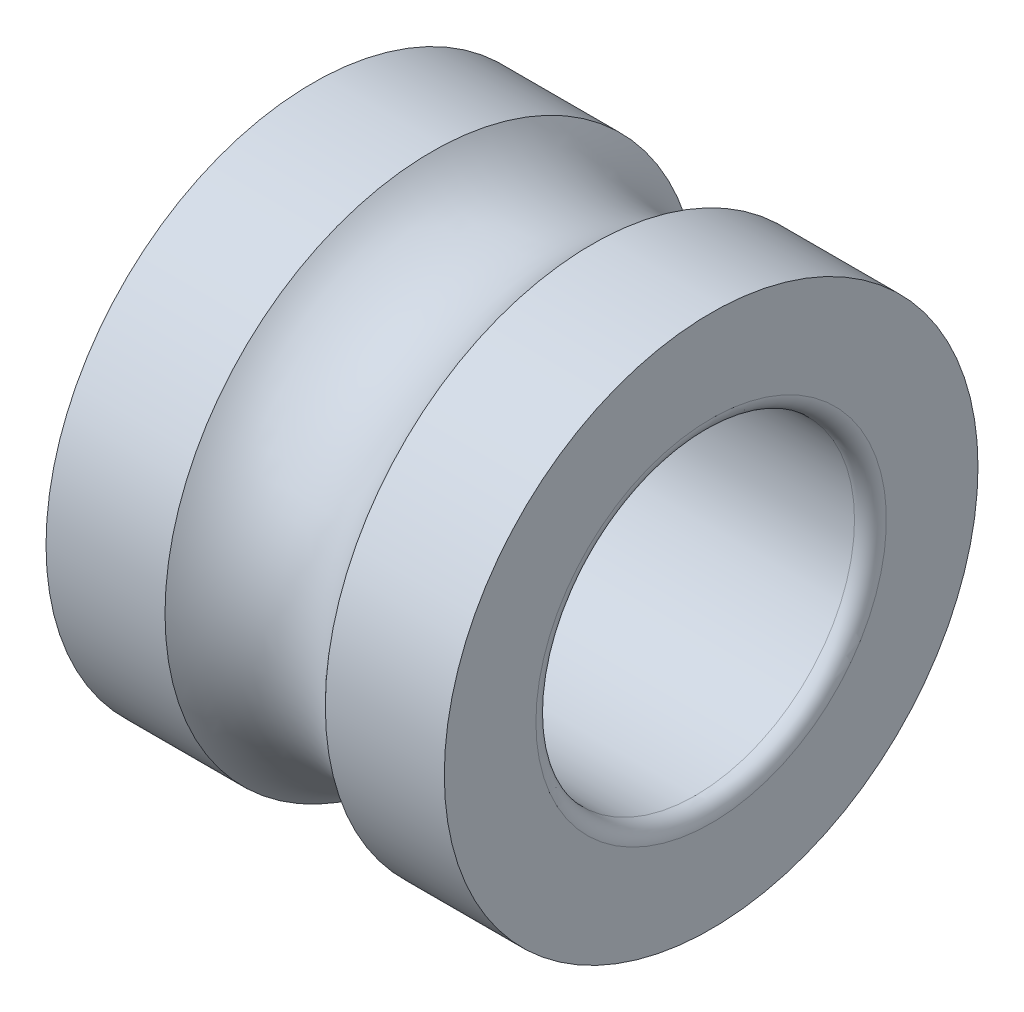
ISO-10303-21;
HEADER;
FILE_DESCRIPTION(('STEP AP214'),'2;1');
FILE_NAME('part.step','',(''),(''),'','','');
FILE_SCHEMA(('AUTOMOTIVE_DESIGN { 1 0 10303 214 1 1 1 1 }'));
ENDSEC;
DATA;
#1=APPLICATION_CONTEXT('core data for automotive mechanical design processes');
#2=APPLICATION_PROTOCOL_DEFINITION('international standard','automotive_design',2000,#1);
#3=PRODUCT_CONTEXT('',#1,'mechanical');
#4=PRODUCT('Part','Part','',(#3));
#5=PRODUCT_RELATED_PRODUCT_CATEGORY('part','',(#4));
#6=PRODUCT_DEFINITION_FORMATION('','',#4);
#7=PRODUCT_DEFINITION_CONTEXT('part definition',#1,'design');
#8=PRODUCT_DEFINITION('design','',#6,#7);
#9=PRODUCT_DEFINITION_SHAPE('','',#8);
#10=(LENGTH_UNIT() NAMED_UNIT(*) SI_UNIT(.MILLI.,.METRE.));
#11=(NAMED_UNIT(*) PLANE_ANGLE_UNIT() SI_UNIT($,.RADIAN.));
#12=(NAMED_UNIT(*) SI_UNIT($,.STERADIAN.) SOLID_ANGLE_UNIT());
#13=UNCERTAINTY_MEASURE_WITH_UNIT(LENGTH_MEASURE(1.E-05),#10,'distance_accuracy_value','');
#14=(GEOMETRIC_REPRESENTATION_CONTEXT(3) GLOBAL_UNCERTAINTY_ASSIGNED_CONTEXT((#13)) GLOBAL_UNIT_ASSIGNED_CONTEXT((#10,
#11,#12)) REPRESENTATION_CONTEXT('',''));
#15=CARTESIAN_POINT('',(0.,0.,0.));
#16=DIRECTION('',(0.,0.,1.));
#17=DIRECTION('',(1.,0.,0.));
#18=AXIS2_PLACEMENT_3D('',#15,#16,#17);
#19=CARTESIAN_POINT('',(0.200000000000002,0.,0.));
#20=DIRECTION('',(-1.,0.,0.));
#21=DIRECTION('',(0.,0.,1.));
#22=AXIS2_PLACEMENT_3D('',#19,#20,#21);
#23=TOROIDAL_SURFACE('',#22,2.2,0.200000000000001);
#24=CARTESIAN_POINT('',(0.200000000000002,0.,0.));
#25=DIRECTION('',(-1.,0.,0.));
#26=DIRECTION('',(0.,0.,1.));
#27=AXIS2_PLACEMENT_3D('',#24,#25,#26);
#28=CIRCLE('',#27,2.);
#29=CARTESIAN_POINT('',(0.200000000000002,0.,2.));
#30=VERTEX_POINT('',#29);
#31=EDGE_CURVE('E10',#30,#30,#28,.T.);
#32=ORIENTED_EDGE('',*,*,#31,.F.);
#33=EDGE_LOOP('',(#32));
#34=FACE_BOUND('',#33,.T.);
#35=CARTESIAN_POINT('',(0.,0.,0.));
#36=DIRECTION('',(-1.,0.,0.));
#37=DIRECTION('',(0.,0.,1.));
#38=AXIS2_PLACEMENT_3D('',#35,#36,#37);
#39=CIRCLE('',#38,2.2);
#40=CARTESIAN_POINT('',(0.,0.,2.2));
#41=VERTEX_POINT('',#40);
#42=EDGE_CURVE('E52',#41,#41,#39,.T.);
#43=ORIENTED_EDGE('',*,*,#42,.T.);
#44=EDGE_LOOP('',(#43));
#45=FACE_BOUND('',#44,.T.);
#46=ADVANCED_FACE('F24',(#34,#45),#23,.T.);
#47=CARTESIAN_POINT('',(0.,0.,0.));
#48=DIRECTION('',(-1.,0.,0.));
#49=DIRECTION('',(0.,0.,1.));
#50=AXIS2_PLACEMENT_3D('',#47,#48,#49);
#51=CYLINDRICAL_SURFACE('',#50,2.);
#52=CARTESIAN_POINT('',(4.8,0.,0.));
#53=DIRECTION('',(-1.,0.,0.));
#54=DIRECTION('',(0.,0.,1.));
#55=AXIS2_PLACEMENT_3D('',#52,#53,#54);
#56=CIRCLE('',#55,2.);
#57=CARTESIAN_POINT('',(4.8,0.,2.));
#58=VERTEX_POINT('',#57);
#59=EDGE_CURVE('E30',#58,#58,#56,.T.);
#60=ORIENTED_EDGE('',*,*,#59,.F.);
#61=EDGE_LOOP('',(#60));
#62=FACE_BOUND('',#61,.T.);
#63=ORIENTED_EDGE('',*,*,#31,.T.);
#64=EDGE_LOOP('',(#63));
#65=FACE_BOUND('',#64,.T.);
#66=ADVANCED_FACE('F89',(#62,#65),#51,.F.);
#67=CARTESIAN_POINT('',(4.8,0.,0.));
#68=DIRECTION('',(-1.,0.,0.));
#69=DIRECTION('',(0.,0.,1.));
#70=AXIS2_PLACEMENT_3D('',#67,#68,#69);
#71=TOROIDAL_SURFACE('',#70,2.2,0.200000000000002);
#72=CARTESIAN_POINT('',(5.,0.,0.));
#73=DIRECTION('',(-1.,0.,0.));
#74=DIRECTION('',(0.,0.,1.));
#75=AXIS2_PLACEMENT_3D('',#72,#73,#74);
#76=CIRCLE('',#75,2.2);
#77=CARTESIAN_POINT('',(5.,0.,2.2));
#78=VERTEX_POINT('',#77);
#79=EDGE_CURVE('E34',#78,#78,#76,.T.);
#80=ORIENTED_EDGE('',*,*,#79,.F.);
#81=EDGE_LOOP('',(#80));
#82=FACE_BOUND('',#81,.T.);
#83=ORIENTED_EDGE('',*,*,#59,.T.);
#84=EDGE_LOOP('',(#83));
#85=FACE_BOUND('',#84,.T.);
#86=ADVANCED_FACE('F84',(#82,#85),#71,.T.);
#87=CARTESIAN_POINT('',(5.,0.,-3.35));
#88=DIRECTION('',(-1.,0.,0.));
#89=DIRECTION('',(0.,0.,1.));
#90=AXIS2_PLACEMENT_3D('',#87,#88,#89);
#91=PLANE('',#90);
#92=CARTESIAN_POINT('',(5.,0.,0.));
#93=DIRECTION('',(-1.,0.,0.));
#94=DIRECTION('',(0.,0.,1.));
#95=AXIS2_PLACEMENT_3D('',#92,#93,#94);
#96=CIRCLE('',#95,3.35);
#97=CARTESIAN_POINT('',(5.,0.,3.35));
#98=VERTEX_POINT('',#97);
#99=EDGE_CURVE('E38',#98,#98,#96,.T.);
#100=ORIENTED_EDGE('',*,*,#99,.F.);
#101=EDGE_LOOP('',(#100));
#102=FACE_BOUND('',#101,.T.);
#103=ORIENTED_EDGE('',*,*,#79,.T.);
#104=EDGE_LOOP('',(#103));
#105=FACE_BOUND('',#104,.T.);
#106=ADVANCED_FACE('F78',(#102,#105),#91,.F.);
#107=CARTESIAN_POINT('',(0.,0.,0.));
#108=DIRECTION('',(-1.,0.,0.));
#109=DIRECTION('',(0.,0.,1.));
#110=AXIS2_PLACEMENT_3D('',#107,#108,#109);
#111=CYLINDRICAL_SURFACE('',#110,3.35);
#112=CARTESIAN_POINT('',(3.50623058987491,0.,0.));
#113=DIRECTION('',(-1.,0.,0.));
#114=DIRECTION('',(0.,0.,1.));
#115=AXIS2_PLACEMENT_3D('',#112,#113,#114);
#116=CIRCLE('',#115,3.35);
#117=CARTESIAN_POINT('',(3.50623058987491,0.,3.35));
#118=VERTEX_POINT('',#117);
#119=EDGE_CURVE('E43',#118,#118,#116,.T.);
#120=ORIENTED_EDGE('',*,*,#119,.F.);
#121=EDGE_LOOP('',(#120));
#122=FACE_BOUND('',#121,.T.);
#123=ORIENTED_EDGE('',*,*,#99,.T.);
#124=EDGE_LOOP('',(#123));
#125=FACE_BOUND('',#124,.T.);
#126=ADVANCED_FACE('F72',(#122,#125),#111,.T.);
#127=CARTESIAN_POINT('',(2.5,0.,0.));
#128=DIRECTION('',(-1.,0.,0.));
#129=DIRECTION('',(0.,0.,1.));
#130=AXIS2_PLACEMENT_3D('',#127,#128,#129);
#131=TOROIDAL_SURFACE('',#130,4.25,1.35);
#132=CARTESIAN_POINT('',(1.4937694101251,0.,0.));
#133=DIRECTION('',(-1.,0.,0.));
#134=DIRECTION('',(0.,0.,1.));
#135=AXIS2_PLACEMENT_3D('',#132,#133,#134);
#136=CIRCLE('',#135,3.35);
#137=CARTESIAN_POINT('',(1.4937694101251,0.,3.35));
#138=VERTEX_POINT('',#137);
#139=EDGE_CURVE('E46',#138,#138,#136,.T.);
#140=ORIENTED_EDGE('',*,*,#139,.F.);
#141=EDGE_LOOP('',(#140));
#142=FACE_BOUND('',#141,.T.);
#143=ORIENTED_EDGE('',*,*,#119,.T.);
#144=EDGE_LOOP('',(#143));
#145=FACE_BOUND('',#144,.T.);
#146=ADVANCED_FACE('F66',(#142,#145),#131,.F.);
#147=CARTESIAN_POINT('',(0.,0.,0.));
#148=DIRECTION('',(-1.,0.,0.));
#149=DIRECTION('',(0.,0.,1.));
#150=AXIS2_PLACEMENT_3D('',#147,#148,#149);
#151=CYLINDRICAL_SURFACE('',#150,3.35);
#152=CARTESIAN_POINT('',(0.,0.,0.));
#153=DIRECTION('',(-1.,0.,0.));
#154=DIRECTION('',(0.,0.,1.));
#155=AXIS2_PLACEMENT_3D('',#152,#153,#154);
#156=CIRCLE('',#155,3.35);
#157=CARTESIAN_POINT('',(0.,0.,3.35));
#158=VERTEX_POINT('',#157);
#159=EDGE_CURVE('E49',#158,#158,#156,.T.);
#160=ORIENTED_EDGE('',*,*,#159,.F.);
#161=EDGE_LOOP('',(#160));
#162=FACE_BOUND('',#161,.T.);
#163=ORIENTED_EDGE('',*,*,#139,.T.);
#164=EDGE_LOOP('',(#163));
#165=FACE_BOUND('',#164,.T.);
#166=ADVANCED_FACE('F60',(#162,#165),#151,.T.);
#167=CARTESIAN_POINT('',(0.,0.,-3.35));
#168=DIRECTION('',(1.,0.,0.));
#169=DIRECTION('',(0.,0.,-1.));
#170=AXIS2_PLACEMENT_3D('',#167,#168,#169);
#171=PLANE('',#170);
#172=ORIENTED_EDGE('',*,*,#42,.F.);
#173=EDGE_LOOP('',(#172));
#174=FACE_BOUND('',#173,.T.);
#175=ORIENTED_EDGE('',*,*,#159,.T.);
#176=EDGE_LOOP('',(#175));
#177=FACE_BOUND('',#176,.T.);
#178=ADVANCED_FACE('F57',(#174,#177),#171,.F.);
#179=CLOSED_SHELL('',(#46,#66,#86,#106,#126,#146,#166,#178));
#180=MANIFOLD_SOLID_BREP('B2',#179);
#181=ADVANCED_BREP_SHAPE_REPRESENTATION('',(#18,#180),#14);
#182=SHAPE_DEFINITION_REPRESENTATION(#9,#181);
ENDSEC;
END-ISO-10303-21;
